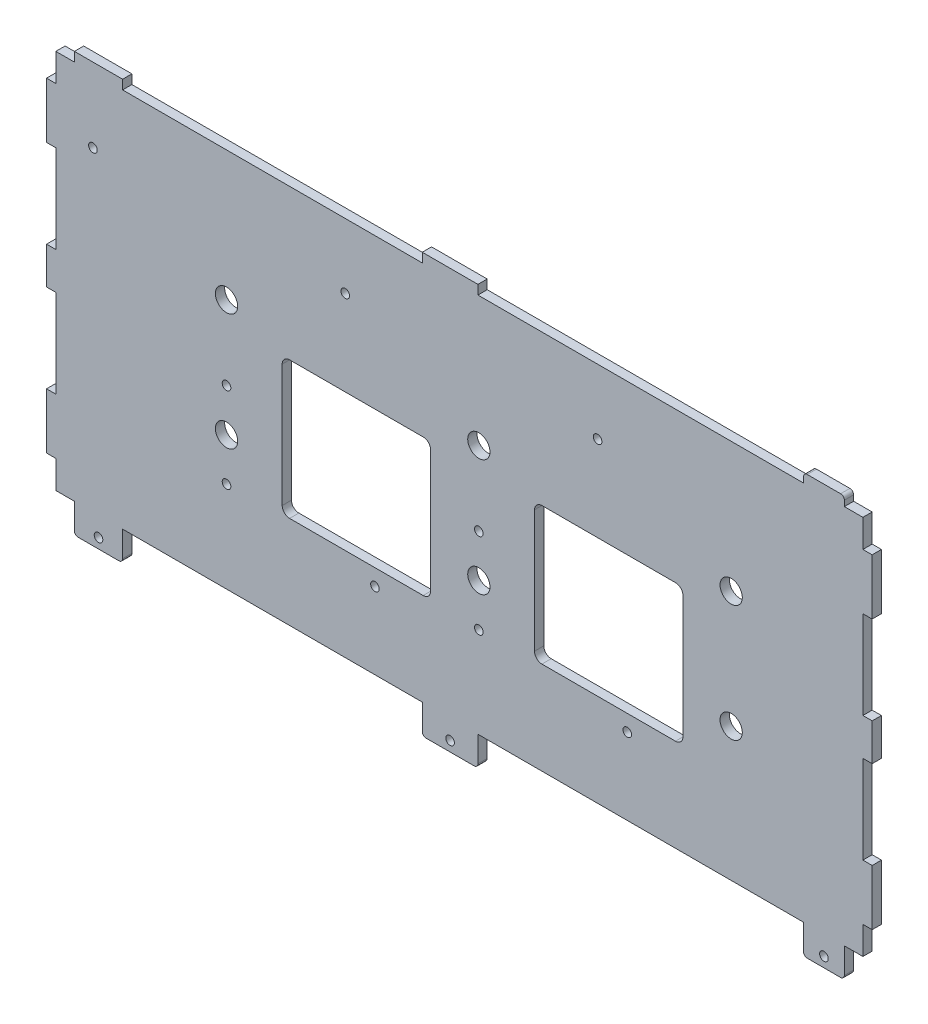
from build123d import *

# Parameters (mm, degrees)
SKETCH1_W             = 276.225
SKETCH1_H             = 130.175
SKETCH1_R             = 3.81
SKETCH1_W_2           = 50.8
SKETCH1_H_2           = 46.99
BOSS_EXTRUDE1_DEPTH   = 3.175
FILLET1_R             = 2.54
SKETCH4_W             = 3.175
SKETCH4_H             = 19.05
SKETCH4_H_2           = 12.7
SKETCH4_W_2           = 16.51
SKETCH4_H_3           = 10.033
SKETCH4_W_3           = 19.05
SKETCH4_W_4           = 13.97
SKETCH4_H_4           = 3.175
BOSS_EXTRUDE2_DEPTH   = 3.175
F_4_CLEARANCE_HOLE1_D = 2.9464
FILLET2_R             = 1.27


with BuildPart() as part:
    # Sketch1 → Boss-Extrude1 (new body)
    with BuildSketch(Plane.XY):
        with Locations((138.1125, 65.0875)):
            Rectangle(SKETCH1_W, SKETCH1_H)
        with Locations((58.42, 85.725)):
            Circle(SKETCH1_R, mode=Mode.SUBTRACT)
        with Locations((58.42, 45.72)):
            Circle(SKETCH1_R, mode=Mode.SUBTRACT)
        with Locations(Location((144.78, 45.72, 0), (0, 0, 180))):
            Circle(SKETCH1_R, mode=Mode.SUBTRACT)
        with Locations(Location((144.78, 85.725, 0), (0, 0, 180))):
            Circle(SKETCH1_R, mode=Mode.SUBTRACT)
        with Locations((231.14, 85.725)):
            Circle(SKETCH1_R, mode=Mode.SUBTRACT)
        with Locations((231.14, 45.72)):
            Circle(SKETCH1_R, mode=Mode.SUBTRACT)
        with Locations((102.87, 55.245)):
            Rectangle(SKETCH1_W_2, SKETCH1_H_2, mode=Mode.SUBTRACT)
        with Locations((189.23, 55.245)):
            Rectangle(SKETCH1_W_2, SKETCH1_H_2, mode=Mode.SUBTRACT)
    extrude(amount=BOSS_EXTRUDE1_DEPTH)

    # Fillet1
    fillet1_edges = [part.edges().sort_by_distance(p)[0] for p in [
        (128.27, 31.75, 1.5875),
        (128.27, 78.74, 1.5875),
        (77.47, 78.74, 1.5875),
        (77.47, 31.75, 1.5875),
        (214.63, 31.75, 1.5875),
        (214.63, 78.74, 1.5875),
        (163.83, 78.74, 1.5875),
        (163.83, 31.75, 1.5875),
    ]]
    fillet(fillet1_edges, radius=FILLET1_R)

    # Sketch4 → Boss-Extrude2 (add)
    with BuildSketch(Plane.XY):
        with Locations((277.8125, 19.05)):
            Rectangle(SKETCH4_W, SKETCH4_H)
        with Locations((277.8125, 111.125)):
            Rectangle(SKETCH4_W, SKETCH4_H)
        with Locations((-1.5875, 65.0875)):
            Rectangle(SKETCH4_W, SKETCH4_H_2)
        with Locations((277.8125, 65.0875)):
            Rectangle(SKETCH4_W, SKETCH4_H_2)
        with Locations((-1.5875, 19.05)):
            Rectangle(SKETCH4_W, SKETCH4_H)
        with Locations((-1.5875, 111.125)):
            Rectangle(SKETCH4_W, SKETCH4_H)
        with Locations((14.605, -5.0165)):
            Rectangle(SKETCH4_W_2, SKETCH4_H_3)
        with Locations((134.9375, -5.0165)):
            Rectangle(SKETCH4_W_3, SKETCH4_H_3)
        with Locations((262.89, -5.0165)):
            Rectangle(SKETCH4_W_4, SKETCH4_H_3)
        with Locations((14.605, 131.7625)):
            Rectangle(SKETCH4_W_2, SKETCH4_H_4)
        with Locations((134.9375, 131.7625)):
            Rectangle(SKETCH4_W_3, SKETCH4_H_4)
        with Locations((262.89, 131.7625)):
            Rectangle(SKETCH4_W_4, SKETCH4_H_4)
    extrude(amount=BOSS_EXTRUDE2_DEPTH)

    # 4 Clearance Hole1 (through all)
    with Locations(Plane.XY.offset(3.175)):
        with Locations((99.06, 107.95), (12.7, 107.95), (185.42, 107.95), (109.22, 26.162), (195.58, 26.162), (134.9375, -6.604), (14.605, -6.604), (262.89, -6.604), (58.42, 60.325), (58.42, 31.115), (144.78, 60.325), (144.78, 31.115)):
            Hole(F_4_CLEARANCE_HOLE1_D / 2)

    # Fillet2
    fillet2_edges = [part.edges().sort_by_distance(p)[0] for p in [
        (255.905, 133.35, 1.5875),
        (269.875, 133.35, 1.5875),
        (269.875, -10.033, 1.5875),
        (255.905, -10.033, 1.5875),
        (144.4625, -10.033, 1.5875),
        (125.4125, -10.033, 1.5875),
        (22.86, -10.033, 1.5875),
        (6.35, -10.033, 1.5875),
    ]]
    fillet(fillet2_edges, radius=FILLET2_R)


solid = part.part
